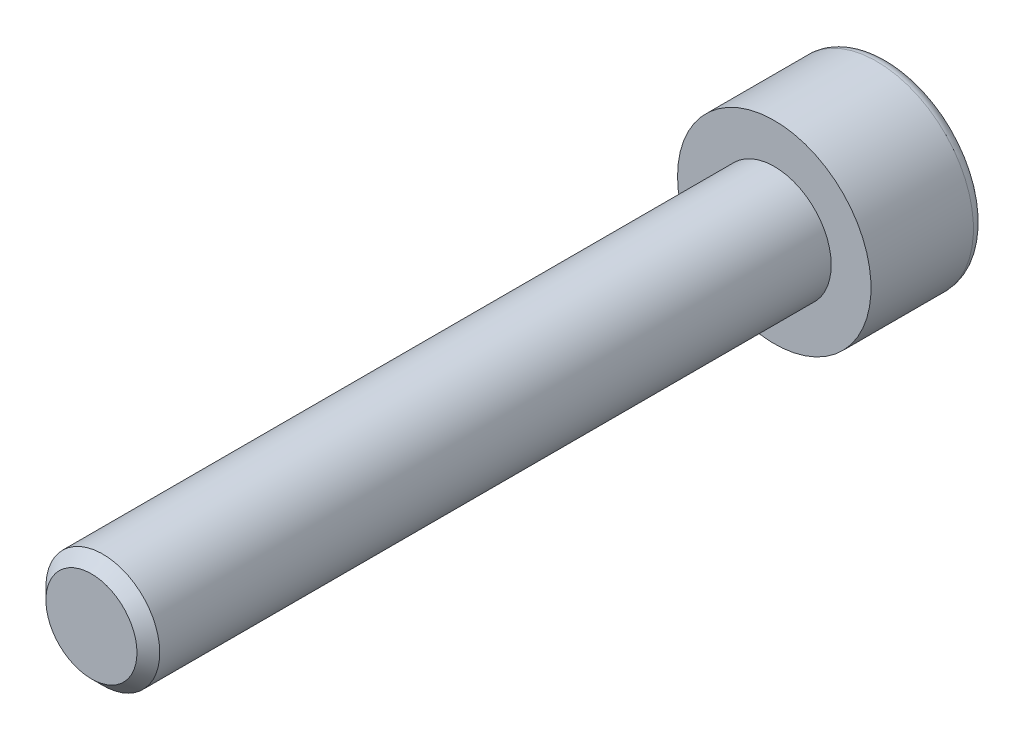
ISO-10303-21;
HEADER;
FILE_DESCRIPTION(('STEP AP214'),'2;1');
FILE_NAME('part.step','',(''),(''),'','','');
FILE_SCHEMA(('AUTOMOTIVE_DESIGN { 1 0 10303 214 1 1 1 1 }'));
ENDSEC;
DATA;
#1=APPLICATION_CONTEXT('core data for automotive mechanical design processes');
#2=APPLICATION_PROTOCOL_DEFINITION('international standard','automotive_design',2000,#1);
#3=PRODUCT_CONTEXT('',#1,'mechanical');
#4=PRODUCT('Part','Part','',(#3));
#5=PRODUCT_RELATED_PRODUCT_CATEGORY('part','',(#4));
#6=PRODUCT_DEFINITION_FORMATION('','',#4);
#7=PRODUCT_DEFINITION_CONTEXT('part definition',#1,'design');
#8=PRODUCT_DEFINITION('design','',#6,#7);
#9=PRODUCT_DEFINITION_SHAPE('','',#8);
#10=(LENGTH_UNIT() NAMED_UNIT(*) SI_UNIT(.MILLI.,.METRE.));
#11=(NAMED_UNIT(*) PLANE_ANGLE_UNIT() SI_UNIT($,.RADIAN.));
#12=(NAMED_UNIT(*) SI_UNIT($,.STERADIAN.) SOLID_ANGLE_UNIT());
#13=UNCERTAINTY_MEASURE_WITH_UNIT(LENGTH_MEASURE(1.E-05),#10,'distance_accuracy_value','');
#14=(GEOMETRIC_REPRESENTATION_CONTEXT(3) GLOBAL_UNCERTAINTY_ASSIGNED_CONTEXT((#13)) GLOBAL_UNIT_ASSIGNED_CONTEXT((#10,
#11,#12)) REPRESENTATION_CONTEXT('',''));
#15=CARTESIAN_POINT('',(0.,0.,0.));
#16=DIRECTION('',(0.,0.,1.));
#17=DIRECTION('',(1.,0.,0.));
#18=AXIS2_PLACEMENT_3D('',#15,#16,#17);
#19=CARTESIAN_POINT('',(0.,0.,-5.));
#20=DIRECTION('',(0.,0.,1.));
#21=DIRECTION('',(1.,0.,0.));
#22=AXIS2_PLACEMENT_3D('',#19,#20,#21);
#23=PLANE('',#22);
#24=CARTESIAN_POINT('',(0.,0.,-5.));
#25=DIRECTION('',(0.,0.,-1.));
#26=DIRECTION('',(-1.,0.,0.));
#27=AXIS2_PLACEMENT_3D('',#24,#25,#26);
#28=CIRCLE('',#27,3.75);
#29=CARTESIAN_POINT('',(-3.75,0.,-5.));
#30=VERTEX_POINT('',#29);
#31=EDGE_CURVE('E141',#30,#30,#28,.T.);
#32=ORIENTED_EDGE('',*,*,#31,.T.);
#33=EDGE_LOOP('',(#32));
#34=FACE_BOUND('',#33,.T.);
#35=DIRECTION('',(-0.86602540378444,0.499999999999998,0.));
#36=VECTOR('',#35,1.);
#37=CARTESIAN_POINT('',(0.,2.30940107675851,-5.));
#38=LINE('',#37,#36);
#39=CARTESIAN_POINT('',(2.,1.15470053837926,-5.));
#40=VERTEX_POINT('',#39);
#41=CARTESIAN_POINT('',(0.,2.30940107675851,-5.));
#42=VERTEX_POINT('',#41);
#43=EDGE_CURVE('E45',#40,#42,#38,.T.);
#44=ORIENTED_EDGE('',*,*,#43,.T.);
#45=DIRECTION('',(-0.866025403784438,-0.500000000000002,0.));
#46=VECTOR('',#45,1.);
#47=CARTESIAN_POINT('',(0.,2.30940107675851,-5.));
#48=LINE('',#47,#46);
#49=CARTESIAN_POINT('',(-2.,1.15470053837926,-5.));
#50=VERTEX_POINT('',#49);
#51=EDGE_CURVE('E85',#42,#50,#48,.T.);
#52=ORIENTED_EDGE('',*,*,#51,.T.);
#53=DIRECTION('',(0.,-1.,0.));
#54=VECTOR('',#53,1.);
#55=CARTESIAN_POINT('',(-2.,-1.15470053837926,-5.));
#56=LINE('',#55,#54);
#57=CARTESIAN_POINT('',(-2.,-1.15470053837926,-5.));
#58=VERTEX_POINT('',#57);
#59=EDGE_CURVE('E93',#50,#58,#56,.T.);
#60=ORIENTED_EDGE('',*,*,#59,.T.);
#61=DIRECTION('',(0.866025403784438,-0.500000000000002,0.));
#62=VECTOR('',#61,1.);
#63=CARTESIAN_POINT('',(0.,-2.30940107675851,-5.));
#64=LINE('',#63,#62);
#65=CARTESIAN_POINT('',(0.,-2.30940107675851,-5.));
#66=VERTEX_POINT('',#65);
#67=EDGE_CURVE('E111',#58,#66,#64,.T.);
#68=ORIENTED_EDGE('',*,*,#67,.T.);
#69=DIRECTION('',(0.86602540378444,0.499999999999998,0.));
#70=VECTOR('',#69,1.);
#71=CARTESIAN_POINT('',(0.,-2.30940107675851,-5.));
#72=LINE('',#71,#70);
#73=CARTESIAN_POINT('',(2.,-1.15470053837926,-5.));
#74=VERTEX_POINT('',#73);
#75=EDGE_CURVE('E114',#66,#74,#72,.T.);
#76=ORIENTED_EDGE('',*,*,#75,.T.);
#77=DIRECTION('',(0.,1.,0.));
#78=VECTOR('',#77,1.);
#79=CARTESIAN_POINT('',(2.,-1.15470053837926,-5.));
#80=LINE('',#79,#78);
#81=EDGE_CURVE('E104',#74,#40,#80,.T.);
#82=ORIENTED_EDGE('',*,*,#81,.T.);
#83=EDGE_LOOP('',(#44,#52,#60,#68,#76,#82));
#84=FACE_BOUND('',#83,.T.);
#85=ADVANCED_FACE('F31',(#34,#84),#23,.F.);
#86=CARTESIAN_POINT('',(0.,0.,-4.5));
#87=DIRECTION('',(0.,0.,-1.));
#88=DIRECTION('',(-1.,0.,0.));
#89=AXIS2_PLACEMENT_3D('',#86,#87,#88);
#90=TOROIDAL_SURFACE('',#89,3.75,0.5);
#91=ORIENTED_EDGE('',*,*,#31,.F.);
#92=EDGE_LOOP('',(#91));
#93=FACE_BOUND('',#92,.T.);
#94=CARTESIAN_POINT('',(0.,0.,-4.5));
#95=DIRECTION('',(0.,0.,-1.));
#96=DIRECTION('',(-1.,0.,0.));
#97=AXIS2_PLACEMENT_3D('',#94,#95,#96);
#98=CIRCLE('',#97,4.25);
#99=CARTESIAN_POINT('',(-4.25,0.,-4.5));
#100=VERTEX_POINT('',#99);
#101=EDGE_CURVE('E138',#100,#100,#98,.T.);
#102=ORIENTED_EDGE('',*,*,#101,.T.);
#103=EDGE_LOOP('',(#102));
#104=FACE_BOUND('',#103,.T.);
#105=ADVANCED_FACE('F160',(#93,#104),#90,.T.);
#106=CARTESIAN_POINT('',(0.,0.,0.));
#107=DIRECTION('',(0.,0.,-1.));
#108=DIRECTION('',(-1.,0.,0.));
#109=AXIS2_PLACEMENT_3D('',#106,#107,#108);
#110=CYLINDRICAL_SURFACE('',#109,4.25);
#111=ORIENTED_EDGE('',*,*,#101,.F.);
#112=EDGE_LOOP('',(#111));
#113=FACE_BOUND('',#112,.T.);
#114=CARTESIAN_POINT('',(0.,0.,0.));
#115=DIRECTION('',(0.,0.,-1.));
#116=DIRECTION('',(-1.,0.,0.));
#117=AXIS2_PLACEMENT_3D('',#114,#115,#116);
#118=CIRCLE('',#117,4.25);
#119=CARTESIAN_POINT('',(-4.25,0.,0.));
#120=VERTEX_POINT('',#119);
#121=EDGE_CURVE('E99',#120,#120,#118,.T.);
#122=ORIENTED_EDGE('',*,*,#121,.T.);
#123=EDGE_LOOP('',(#122));
#124=FACE_BOUND('',#123,.T.);
#125=ADVANCED_FACE('F165',(#113,#124),#110,.T.);
#126=CARTESIAN_POINT('',(0.,0.,0.));
#127=DIRECTION('',(0.,0.,-1.));
#128=DIRECTION('',(-1.,0.,0.));
#129=AXIS2_PLACEMENT_3D('',#126,#127,#128);
#130=PLANE('',#129);
#131=CARTESIAN_POINT('',(0.,0.,0.));
#132=DIRECTION('',(0.,0.,1.));
#133=DIRECTION('',(1.,0.,0.));
#134=AXIS2_PLACEMENT_3D('',#131,#132,#133);
#135=CIRCLE('',#134,2.5);
#136=CARTESIAN_POINT('',(2.5,0.,0.));
#137=VERTEX_POINT('',#136);
#138=EDGE_CURVE('E105',#137,#137,#135,.T.);
#139=ORIENTED_EDGE('',*,*,#138,.F.);
#140=EDGE_LOOP('',(#139));
#141=FACE_BOUND('',#140,.T.);
#142=ORIENTED_EDGE('',*,*,#121,.F.);
#143=EDGE_LOOP('',(#142));
#144=FACE_BOUND('',#143,.T.);
#145=ADVANCED_FACE('F173',(#141,#144),#130,.F.);
#146=CARTESIAN_POINT('',(0.,2.30940107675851,-2.5));
#147=DIRECTION('',(-0.499999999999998,-0.86602540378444,0.));
#148=DIRECTION('',(0.86602540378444,-0.499999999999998,0.));
#149=AXIS2_PLACEMENT_3D('',#146,#147,#148);
#150=PLANE('',#149);
#151=ORIENTED_EDGE('',*,*,#43,.F.);
#152=DIRECTION('',(0.,0.,-1.));
#153=VECTOR('',#152,1.);
#154=CARTESIAN_POINT('',(2.,1.15470053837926,-2.5));
#155=LINE('',#154,#153);
#156=CARTESIAN_POINT('',(2.,1.15470053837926,-2.5));
#157=VERTEX_POINT('',#156);
#158=EDGE_CURVE('E127',#157,#40,#155,.T.);
#159=ORIENTED_EDGE('',*,*,#158,.F.);
#160=DIRECTION('',(-0.86602540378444,0.499999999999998,0.));
#161=VECTOR('',#160,1.);
#162=CARTESIAN_POINT('',(0.,2.30940107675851,-2.5));
#163=LINE('',#162,#161);
#164=CARTESIAN_POINT('',(0.,2.30940107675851,-2.5));
#165=VERTEX_POINT('',#164);
#166=EDGE_CURVE('E98',#157,#165,#163,.T.);
#167=ORIENTED_EDGE('',*,*,#166,.T.);
#168=DIRECTION('',(0.,0.,-1.));
#169=VECTOR('',#168,1.);
#170=CARTESIAN_POINT('',(0.,2.30940107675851,-2.5));
#171=LINE('',#170,#169);
#172=EDGE_CURVE('E87',#165,#42,#171,.T.);
#173=ORIENTED_EDGE('',*,*,#172,.T.);
#174=EDGE_LOOP('',(#151,#159,#167,#173));
#175=FACE_BOUND('',#174,.T.);
#176=ADVANCED_FACE('F96',(#175),#150,.T.);
#177=CARTESIAN_POINT('',(0.,2.30940107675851,-2.5));
#178=DIRECTION('',(0.500000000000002,-0.866025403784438,0.));
#179=DIRECTION('',(0.866025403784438,0.500000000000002,0.));
#180=AXIS2_PLACEMENT_3D('',#177,#178,#179);
#181=PLANE('',#180);
#182=ORIENTED_EDGE('',*,*,#51,.F.);
#183=ORIENTED_EDGE('',*,*,#172,.F.);
#184=DIRECTION('',(-0.866025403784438,-0.500000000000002,0.));
#185=VECTOR('',#184,1.);
#186=CARTESIAN_POINT('',(0.,2.30940107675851,-2.5));
#187=LINE('',#186,#185);
#188=CARTESIAN_POINT('',(-2.,1.15470053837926,-2.5));
#189=VERTEX_POINT('',#188);
#190=EDGE_CURVE('E118',#165,#189,#187,.T.);
#191=ORIENTED_EDGE('',*,*,#190,.T.);
#192=DIRECTION('',(0.,0.,-1.));
#193=VECTOR('',#192,1.);
#194=CARTESIAN_POINT('',(-2.,1.15470053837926,-2.5));
#195=LINE('',#194,#193);
#196=EDGE_CURVE('E89',#189,#50,#195,.T.);
#197=ORIENTED_EDGE('',*,*,#196,.T.);
#198=EDGE_LOOP('',(#182,#183,#191,#197));
#199=FACE_BOUND('',#198,.T.);
#200=ADVANCED_FACE('F86',(#199),#181,.T.);
#201=CARTESIAN_POINT('',(-2.,-1.15470053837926,-2.5));
#202=DIRECTION('',(1.,0.,0.));
#203=DIRECTION('',(0.,0.,-1.));
#204=AXIS2_PLACEMENT_3D('',#201,#202,#203);
#205=PLANE('',#204);
#206=ORIENTED_EDGE('',*,*,#59,.F.);
#207=ORIENTED_EDGE('',*,*,#196,.F.);
#208=DIRECTION('',(0.,-1.,0.));
#209=VECTOR('',#208,1.);
#210=CARTESIAN_POINT('',(-2.,-1.15470053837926,-2.5));
#211=LINE('',#210,#209);
#212=CARTESIAN_POINT('',(-2.,-1.15470053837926,-2.5));
#213=VERTEX_POINT('',#212);
#214=EDGE_CURVE('E120',#189,#213,#211,.T.);
#215=ORIENTED_EDGE('',*,*,#214,.T.);
#216=DIRECTION('',(0.,0.,-1.));
#217=VECTOR('',#216,1.);
#218=CARTESIAN_POINT('',(-2.,-1.15470053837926,-2.5));
#219=LINE('',#218,#217);
#220=EDGE_CURVE('E133',#213,#58,#219,.T.);
#221=ORIENTED_EDGE('',*,*,#220,.T.);
#222=EDGE_LOOP('',(#206,#207,#215,#221));
#223=FACE_BOUND('',#222,.T.);
#224=ADVANCED_FACE('F188',(#223),#205,.T.);
#225=CARTESIAN_POINT('',(0.,-2.30940107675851,-2.5));
#226=DIRECTION('',(0.500000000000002,0.866025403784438,0.));
#227=DIRECTION('',(-0.866025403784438,0.500000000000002,0.));
#228=AXIS2_PLACEMENT_3D('',#225,#226,#227);
#229=PLANE('',#228);
#230=ORIENTED_EDGE('',*,*,#67,.F.);
#231=ORIENTED_EDGE('',*,*,#220,.F.);
#232=DIRECTION('',(0.866025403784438,-0.500000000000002,0.));
#233=VECTOR('',#232,1.);
#234=CARTESIAN_POINT('',(0.,-2.30940107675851,-2.5));
#235=LINE('',#234,#233);
#236=CARTESIAN_POINT('',(0.,-2.30940107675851,-2.5));
#237=VERTEX_POINT('',#236);
#238=EDGE_CURVE('E122',#213,#237,#235,.T.);
#239=ORIENTED_EDGE('',*,*,#238,.T.);
#240=DIRECTION('',(0.,0.,-1.));
#241=VECTOR('',#240,1.);
#242=CARTESIAN_POINT('',(0.,-2.30940107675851,-2.5));
#243=LINE('',#242,#241);
#244=EDGE_CURVE('E131',#237,#66,#243,.T.);
#245=ORIENTED_EDGE('',*,*,#244,.T.);
#246=EDGE_LOOP('',(#230,#231,#239,#245));
#247=FACE_BOUND('',#246,.T.);
#248=ADVANCED_FACE('F191',(#247),#229,.T.);
#249=CARTESIAN_POINT('',(0.,-2.30940107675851,-2.5));
#250=DIRECTION('',(-0.499999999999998,0.86602540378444,0.));
#251=DIRECTION('',(-0.86602540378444,-0.499999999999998,0.));
#252=AXIS2_PLACEMENT_3D('',#249,#250,#251);
#253=PLANE('',#252);
#254=ORIENTED_EDGE('',*,*,#75,.F.);
#255=ORIENTED_EDGE('',*,*,#244,.F.);
#256=DIRECTION('',(0.86602540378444,0.499999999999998,0.));
#257=VECTOR('',#256,1.);
#258=CARTESIAN_POINT('',(0.,-2.30940107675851,-2.5));
#259=LINE('',#258,#257);
#260=CARTESIAN_POINT('',(2.,-1.15470053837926,-2.5));
#261=VERTEX_POINT('',#260);
#262=EDGE_CURVE('E124',#237,#261,#259,.T.);
#263=ORIENTED_EDGE('',*,*,#262,.T.);
#264=DIRECTION('',(0.,0.,-1.));
#265=VECTOR('',#264,1.);
#266=CARTESIAN_POINT('',(2.,-1.15470053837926,-2.5));
#267=LINE('',#266,#265);
#268=EDGE_CURVE('E129',#261,#74,#267,.T.);
#269=ORIENTED_EDGE('',*,*,#268,.T.);
#270=EDGE_LOOP('',(#254,#255,#263,#269));
#271=FACE_BOUND('',#270,.T.);
#272=ADVANCED_FACE('F195',(#271),#253,.T.);
#273=CARTESIAN_POINT('',(2.,-1.15470053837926,-2.5));
#274=DIRECTION('',(-1.,0.,0.));
#275=DIRECTION('',(0.,0.,1.));
#276=AXIS2_PLACEMENT_3D('',#273,#274,#275);
#277=PLANE('',#276);
#278=ORIENTED_EDGE('',*,*,#81,.F.);
#279=ORIENTED_EDGE('',*,*,#268,.F.);
#280=DIRECTION('',(0.,1.,0.));
#281=VECTOR('',#280,1.);
#282=CARTESIAN_POINT('',(2.,-1.15470053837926,-2.5));
#283=LINE('',#282,#281);
#284=EDGE_CURVE('E52',#261,#157,#283,.T.);
#285=ORIENTED_EDGE('',*,*,#284,.T.);
#286=ORIENTED_EDGE('',*,*,#158,.T.);
#287=EDGE_LOOP('',(#278,#279,#285,#286));
#288=FACE_BOUND('',#287,.T.);
#289=ADVANCED_FACE('F199',(#288),#277,.T.);
#290=CARTESIAN_POINT('',(2.,1.15470053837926,-2.5));
#291=DIRECTION('',(0.,0.,1.));
#292=DIRECTION('',(1.,0.,0.));
#293=AXIS2_PLACEMENT_3D('',#290,#291,#292);
#294=PLANE('',#293);
#295=ORIENTED_EDGE('',*,*,#166,.F.);
#296=ORIENTED_EDGE('',*,*,#284,.F.);
#297=ORIENTED_EDGE('',*,*,#262,.F.);
#298=ORIENTED_EDGE('',*,*,#238,.F.);
#299=ORIENTED_EDGE('',*,*,#214,.F.);
#300=ORIENTED_EDGE('',*,*,#190,.F.);
#301=EDGE_LOOP('',(#295,#296,#297,#298,#299,#300));
#302=FACE_BOUND('',#301,.T.);
#303=ADVANCED_FACE('F203',(#302),#294,.F.);
#304=CARTESIAN_POINT('',(0.,0.,30.));
#305=DIRECTION('',(0.,0.,1.));
#306=DIRECTION('',(1.,0.,0.));
#307=AXIS2_PLACEMENT_3D('',#304,#305,#306);
#308=PLANE('',#307);
#309=CARTESIAN_POINT('',(0.,0.,30.));
#310=DIRECTION('',(0.,0.,1.));
#311=DIRECTION('',(1.,0.,0.));
#312=AXIS2_PLACEMENT_3D('',#309,#310,#311);
#313=CIRCLE('',#312,2.);
#314=CARTESIAN_POINT('',(2.,0.,30.));
#315=VERTEX_POINT('',#314);
#316=EDGE_CURVE('E38',#315,#315,#313,.T.);
#317=ORIENTED_EDGE('',*,*,#316,.T.);
#318=EDGE_LOOP('',(#317));
#319=FACE_BOUND('',#318,.T.);
#320=ADVANCED_FACE('F146',(#319),#308,.T.);
#321=CARTESIAN_POINT('',(0.,0.,0.));
#322=DIRECTION('',(0.,0.,1.));
#323=DIRECTION('',(1.,0.,0.));
#324=AXIS2_PLACEMENT_3D('',#321,#322,#323);
#325=CYLINDRICAL_SURFACE('',#324,2.5);
#326=CARTESIAN_POINT('',(0.,0.,29.5));
#327=DIRECTION('',(0.,0.,1.));
#328=DIRECTION('',(1.,0.,0.));
#329=AXIS2_PLACEMENT_3D('',#326,#327,#328);
#330=CIRCLE('',#329,2.5);
#331=CARTESIAN_POINT('',(2.5,0.,29.5));
#332=VERTEX_POINT('',#331);
#333=EDGE_CURVE('E11',#332,#332,#330,.F.);
#334=ORIENTED_EDGE('',*,*,#333,.T.);
#335=EDGE_LOOP('',(#334));
#336=FACE_BOUND('',#335,.T.);
#337=ORIENTED_EDGE('',*,*,#138,.T.);
#338=EDGE_LOOP('',(#337));
#339=FACE_BOUND('',#338,.T.);
#340=ADVANCED_FACE('F150',(#336,#339),#325,.T.);
#341=CARTESIAN_POINT('',(0.,0.,30.));
#342=DIRECTION('',(0.,0.,-1.));
#343=DIRECTION('',(-1.,0.,0.));
#344=AXIS2_PLACEMENT_3D('',#341,#342,#343);
#345=CONICAL_SURFACE('',#344,2.,0.785398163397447);
#346=ORIENTED_EDGE('',*,*,#333,.F.);
#347=EDGE_LOOP('',(#346));
#348=FACE_BOUND('',#347,.T.);
#349=ORIENTED_EDGE('',*,*,#316,.F.);
#350=EDGE_LOOP('',(#349));
#351=FACE_BOUND('',#350,.T.);
#352=ADVANCED_FACE('F148',(#348,#351),#345,.T.);
#353=CLOSED_SHELL('',(#85,#105,#125,#145,#176,#200,#224,#248,#272,#289,#303,#320,#340,#352));
#354=MANIFOLD_SOLID_BREP('B2',#353);
#355=ADVANCED_BREP_SHAPE_REPRESENTATION('',(#18,#354),#14);
#356=SHAPE_DEFINITION_REPRESENTATION(#9,#355);
ENDSEC;
END-ISO-10303-21;
